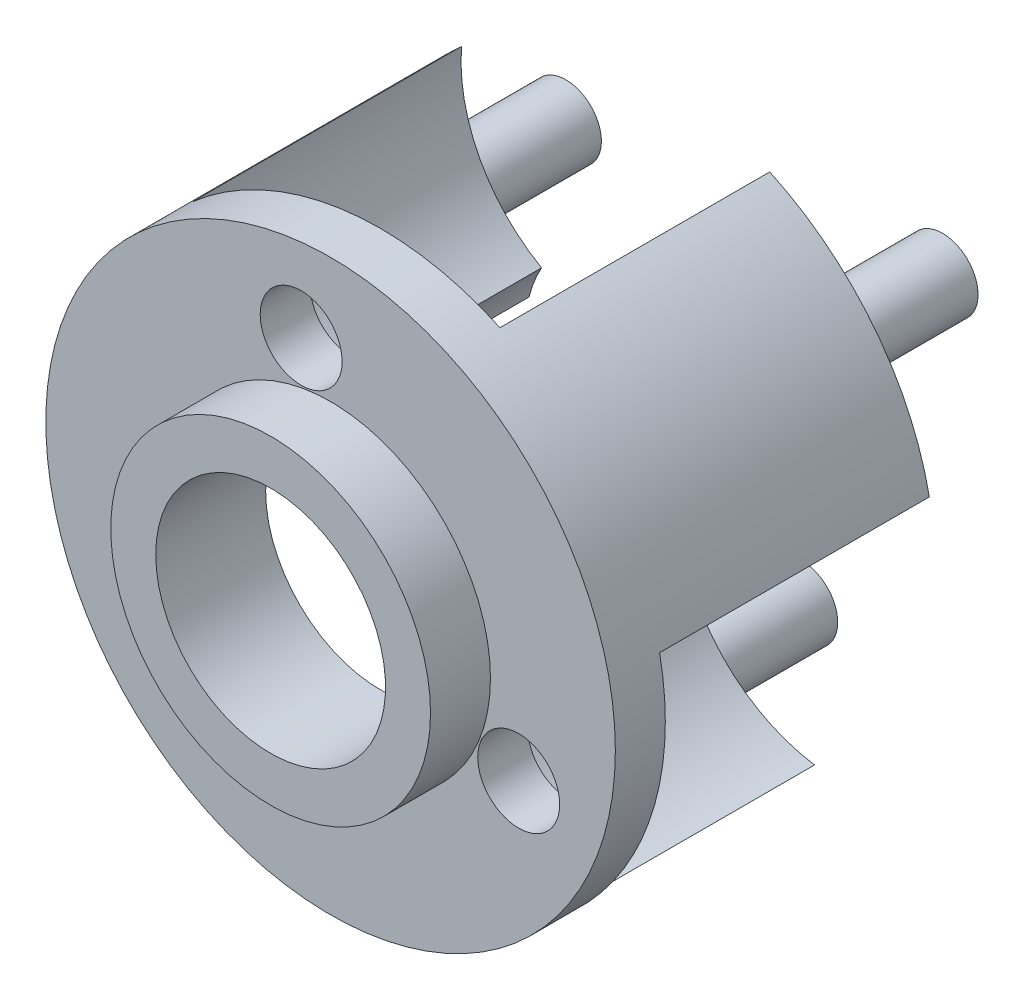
ISO-10303-21;
HEADER;
FILE_DESCRIPTION(('STEP AP214'),'2;1');
FILE_NAME('part.step','',(''),(''),'','','');
FILE_SCHEMA(('AUTOMOTIVE_DESIGN { 1 0 10303 214 1 1 1 1 }'));
ENDSEC;
DATA;
#1=APPLICATION_CONTEXT('core data for automotive mechanical design processes');
#2=APPLICATION_PROTOCOL_DEFINITION('international standard','automotive_design',2000,#1);
#3=PRODUCT_CONTEXT('',#1,'mechanical');
#4=PRODUCT('Part','Part','',(#3));
#5=PRODUCT_RELATED_PRODUCT_CATEGORY('part','',(#4));
#6=PRODUCT_DEFINITION_FORMATION('','',#4);
#7=PRODUCT_DEFINITION_CONTEXT('part definition',#1,'design');
#8=PRODUCT_DEFINITION('design','',#6,#7);
#9=PRODUCT_DEFINITION_SHAPE('','',#8);
#10=(LENGTH_UNIT() NAMED_UNIT(*) SI_UNIT(.MILLI.,.METRE.));
#11=(NAMED_UNIT(*) PLANE_ANGLE_UNIT() SI_UNIT($,.RADIAN.));
#12=(NAMED_UNIT(*) SI_UNIT($,.STERADIAN.) SOLID_ANGLE_UNIT());
#13=UNCERTAINTY_MEASURE_WITH_UNIT(LENGTH_MEASURE(1.E-05),#10,'distance_accuracy_value','');
#14=(GEOMETRIC_REPRESENTATION_CONTEXT(3) GLOBAL_UNCERTAINTY_ASSIGNED_CONTEXT((#13)) GLOBAL_UNIT_ASSIGNED_CONTEXT((#10,
#11,#12)) REPRESENTATION_CONTEXT('',''));
#15=CARTESIAN_POINT('',(0.,0.,0.));
#16=DIRECTION('',(0.,0.,1.));
#17=DIRECTION('',(1.,0.,0.));
#18=AXIS2_PLACEMENT_3D('',#15,#16,#17);
#19=CARTESIAN_POINT('',(0.,0.,6.85));
#20=DIRECTION('',(0.,0.,1.));
#21=DIRECTION('',(1.,0.,0.));
#22=AXIS2_PLACEMENT_3D('',#19,#20,#21);
#23=PLANE('',#22);
#24=CARTESIAN_POINT('',(-1.587669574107,-1.256952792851,6.85));
#25=DIRECTION('',(0.,0.,1.));
#26=DIRECTION('',(1.,0.,0.));
#27=AXIS2_PLACEMENT_3D('',#24,#25,#26);
#28=CIRCLE('',#27,0.409999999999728);
#29=CARTESIAN_POINT('',(-1.17766957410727,-1.256952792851,6.85));
#30=VERTEX_POINT('',#29);
#31=EDGE_CURVE('E363',#30,#30,#28,.T.);
#32=ORIENTED_EDGE('',*,*,#31,.F.);
#33=EDGE_LOOP('',(#32));
#34=FACE_BOUND('',#33,.T.);
#35=CARTESIAN_POINT('',(-0.294718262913,2.003438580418,6.85));
#36=DIRECTION('',(0.,0.,1.));
#37=DIRECTION('',(1.,0.,0.));
#38=AXIS2_PLACEMENT_3D('',#35,#36,#37);
#39=CIRCLE('',#38,0.409999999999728);
#40=CARTESIAN_POINT('',(0.115281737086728,2.003438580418,6.85));
#41=VERTEX_POINT('',#40);
#42=EDGE_CURVE('E369',#41,#41,#39,.T.);
#43=ORIENTED_EDGE('',*,*,#42,.F.);
#44=EDGE_LOOP('',(#43));
#45=FACE_BOUND('',#44,.T.);
#46=CARTESIAN_POINT('',(1.88238783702,-0.7464857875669,6.85));
#47=DIRECTION('',(0.,0.,1.));
#48=DIRECTION('',(1.,0.,0.));
#49=AXIS2_PLACEMENT_3D('',#46,#47,#48);
#50=CIRCLE('',#49,0.409999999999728);
#51=CARTESIAN_POINT('',(2.29238783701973,-0.7464857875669,6.85));
#52=VERTEX_POINT('',#51);
#53=EDGE_CURVE('E375',#52,#52,#50,.T.);
#54=ORIENTED_EDGE('',*,*,#53,.F.);
#55=EDGE_LOOP('',(#54));
#56=FACE_BOUND('',#55,.T.);
#57=CARTESIAN_POINT('',(0.,0.,6.85));
#58=DIRECTION('',(0.,0.,1.));
#59=DIRECTION('',(1.,0.,0.));
#60=AXIS2_PLACEMENT_3D('',#57,#58,#59);
#61=CIRCLE('',#60,2.84999999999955);
#62=CARTESIAN_POINT('',(2.84999999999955,0.,6.85));
#63=VERTEX_POINT('',#62);
#64=EDGE_CURVE('E201',#63,#63,#61,.T.);
#65=ORIENTED_EDGE('',*,*,#64,.T.);
#66=EDGE_LOOP('',(#65));
#67=FACE_BOUND('',#66,.T.);
#68=CARTESIAN_POINT('',(0.,0.,6.85));
#69=DIRECTION('',(0.,0.,1.));
#70=DIRECTION('',(1.,0.,0.));
#71=AXIS2_PLACEMENT_3D('',#68,#69,#70);
#72=CIRCLE('',#71,1.60000000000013);
#73=CARTESIAN_POINT('',(1.60000000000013,0.,6.85));
#74=VERTEX_POINT('',#73);
#75=EDGE_CURVE('E387',#74,#74,#72,.T.);
#76=ORIENTED_EDGE('',*,*,#75,.F.);
#77=EDGE_LOOP('',(#76));
#78=FACE_BOUND('',#77,.T.);
#79=ADVANCED_FACE('F34',(#34,#45,#56,#67,#78),#23,.T.);
#80=CARTESIAN_POINT('',(-0.147359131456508,1.00171929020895,6.35));
#81=DIRECTION('',(0.,0.,-1.));
#82=DIRECTION('',(-1.,0.,0.));
#83=AXIS2_PLACEMENT_3D('',#80,#81,#82);
#84=PLANE('',#83);
#85=CARTESIAN_POINT('',(0.,0.,6.35));
#86=DIRECTION('',(0.,0.,-1.));
#87=DIRECTION('',(-1.,0.,0.));
#88=AXIS2_PLACEMENT_3D('',#85,#86,#87);
#89=CIRCLE('',#88,1.14999999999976);
#90=CARTESIAN_POINT('',(-1.14999999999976,0.,6.35));
#91=VERTEX_POINT('',#90);
#92=EDGE_CURVE('E356',#91,#91,#89,.T.);
#93=ORIENTED_EDGE('',*,*,#92,.F.);
#94=EDGE_LOOP('',(#93));
#95=FACE_BOUND('',#94,.T.);
#96=CARTESIAN_POINT('',(-1.587669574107,-1.256952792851,6.35));
#97=DIRECTION('',(0.,0.,-1.));
#98=DIRECTION('',(-1.,0.,0.));
#99=AXIS2_PLACEMENT_3D('',#96,#97,#98);
#100=CIRCLE('',#99,0.409999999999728);
#101=CARTESIAN_POINT('',(-1.99766957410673,-1.256952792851,6.35));
#102=VERTEX_POINT('',#101);
#103=EDGE_CURVE('E358',#102,#102,#100,.T.);
#104=ORIENTED_EDGE('',*,*,#103,.F.);
#105=EDGE_LOOP('',(#104));
#106=FACE_BOUND('',#105,.T.);
#107=CARTESIAN_POINT('',(-0.294718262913,2.003438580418,6.35));
#108=DIRECTION('',(0.,0.,-1.));
#109=DIRECTION('',(-1.,0.,0.));
#110=AXIS2_PLACEMENT_3D('',#107,#108,#109);
#111=CIRCLE('',#110,0.409999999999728);
#112=CARTESIAN_POINT('',(-0.704718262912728,2.003438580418,6.35));
#113=VERTEX_POINT('',#112);
#114=EDGE_CURVE('E366',#113,#113,#111,.T.);
#115=ORIENTED_EDGE('',*,*,#114,.F.);
#116=EDGE_LOOP('',(#115));
#117=FACE_BOUND('',#116,.T.);
#118=CARTESIAN_POINT('',(1.88238783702,-0.7464857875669,6.35));
#119=DIRECTION('',(0.,0.,-1.));
#120=DIRECTION('',(-1.,0.,0.));
#121=AXIS2_PLACEMENT_3D('',#118,#119,#120);
#122=CIRCLE('',#121,0.409999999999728);
#123=CARTESIAN_POINT('',(1.47238783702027,-0.7464857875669,6.35));
#124=VERTEX_POINT('',#123);
#125=EDGE_CURVE('E372',#124,#124,#122,.T.);
#126=ORIENTED_EDGE('',*,*,#125,.F.);
#127=EDGE_LOOP('',(#126));
#128=FACE_BOUND('',#127,.T.);
#129=CARTESIAN_POINT('',(0.,-1.00071860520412E-13,6.35));
#130=DIRECTION('',(0.,0.,-1.));
#131=DIRECTION('',(-1.,0.,0.));
#132=AXIS2_PLACEMENT_3D('',#129,#130,#131);
#133=CIRCLE('',#132,2.84999999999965);
#134=CARTESIAN_POINT('',(2.79253473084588,0.569429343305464,6.35));
#135=VERTEX_POINT('',#134);
#136=CARTESIAN_POINT('',(1.64331321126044,-2.32852349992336,6.35));
#137=VERTEX_POINT('',#136);
#138=EDGE_CURVE('E178',#135,#137,#133,.T.);
#139=ORIENTED_EDGE('',*,*,#138,.T.);
#140=CARTESIAN_POINT('',(1.88238783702,-0.7464857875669,6.35));
#141=DIRECTION('',(0.,0.,1.));
#142=DIRECTION('',(-1.,0.,0.));
#143=AXIS2_PLACEMENT_3D('',#140,#141,#142);
#144=CIRCLE('',#143,1.59999999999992);
#145=CARTESIAN_POINT('',(0.348164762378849,-1.20053375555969,6.35));
#146=VERTEX_POINT('',#145);
#147=EDGE_CURVE('E54',#146,#137,#144,.T.);
#148=ORIENTED_EDGE('',*,*,#147,.F.);
#149=CARTESIAN_POINT('',(1.85561201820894E-13,0.,6.35));
#150=DIRECTION('',(0.,0.,1.));
#151=DIRECTION('',(-1.,0.,0.));
#152=AXIS2_PLACEMENT_3D('',#149,#150,#151);
#153=CIRCLE('',#152,1.2500000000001);
#154=CARTESIAN_POINT('',(0.0123150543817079,-1.24993933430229,6.35));
#155=VERTEX_POINT('',#154);
#156=EDGE_CURVE('E49',#155,#146,#153,.T.);
#157=ORIENTED_EDGE('',*,*,#156,.F.);
#158=CARTESIAN_POINT('',(-1.58766957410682,-1.25695279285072,6.35));
#159=DIRECTION('',(0.,0.,1.));
#160=DIRECTION('',(-1.,0.,0.));
#161=AXIS2_PLACEMENT_3D('',#158,#159,#160);
#162=CIRCLE('',#161,1.60000000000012);
#163=CARTESIAN_POINT('',(-0.90312708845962,-2.70312068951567,6.35));
#164=VERTEX_POINT('',#163);
#165=EDGE_CURVE('E243',#164,#155,#162,.T.);
#166=ORIENTED_EDGE('',*,*,#165,.F.);
#167=CARTESIAN_POINT('',(-2.8382171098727,-0.258889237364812,6.35));
#168=VERTEX_POINT('',#167);
#169=EDGE_CURVE('E181',#164,#168,#133,.T.);
#170=ORIENTED_EDGE('',*,*,#169,.T.);
#171=CARTESIAN_POINT('',(-1.587669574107,-1.256952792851,6.35));
#172=DIRECTION('',(0.,0.,1.));
#173=DIRECTION('',(-1.,0.,0.));
#174=AXIS2_PLACEMENT_3D('',#171,#172,#173);
#175=CIRCLE('',#174,1.59999999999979);
#176=CARTESIAN_POINT('',(-1.21377511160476,0.298747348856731,6.35));
#177=VERTEX_POINT('',#176);
#178=EDGE_CURVE('E145',#177,#168,#175,.T.);
#179=ORIENTED_EDGE('',*,*,#178,.F.);
#180=CARTESIAN_POINT('',(0.,0.,6.35));
#181=DIRECTION('',(0.,0.,1.));
#182=DIRECTION('',(-1.,0.,0.));
#183=AXIS2_PLACEMENT_3D('',#180,#181,#182);
#184=CIRCLE('',#183,1.25000000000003);
#185=CARTESIAN_POINT('',(-1.08863674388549,0.614304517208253,6.35));
#186=VERTEX_POINT('',#185);
#187=EDGE_CURVE('E158',#186,#177,#184,.T.);
#188=ORIENTED_EDGE('',*,*,#187,.F.);
#189=CARTESIAN_POINT('',(-0.294718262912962,2.00343858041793,6.35));
#190=DIRECTION('',(0.,0.,1.));
#191=DIRECTION('',(-1.,0.,0.));
#192=AXIS2_PLACEMENT_3D('',#189,#190,#191);
#193=CIRCLE('',#192,1.59999999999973);
#194=CARTESIAN_POINT('',(-1.88940764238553,2.13369134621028,6.35));
#195=VERTEX_POINT('',#194);
#196=EDGE_CURVE('E148',#195,#186,#193,.T.);
#197=ORIENTED_EDGE('',*,*,#196,.F.);
#198=CARTESIAN_POINT('',(1.19490389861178,2.58741273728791,6.35));
#199=VERTEX_POINT('',#198);
#200=EDGE_CURVE('E182',#195,#199,#133,.T.);
#201=ORIENTED_EDGE('',*,*,#200,.T.);
#202=CARTESIAN_POINT('',(-0.294718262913,2.003438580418,6.35));
#203=DIRECTION('',(0.,0.,-1.));
#204=DIRECTION('',(-1.,0.,0.));
#205=AXIS2_PLACEMENT_3D('',#202,#203,#204);
#206=CIRCLE('',#205,1.59999999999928);
#207=CARTESIAN_POINT('',(0.865610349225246,0.901786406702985,6.35));
#208=VERTEX_POINT('',#207);
#209=EDGE_CURVE('E180',#199,#208,#206,.T.);
#210=ORIENTED_EDGE('',*,*,#209,.T.);
#211=CARTESIAN_POINT('',(0.,-1.00071860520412E-13,6.35));
#212=DIRECTION('',(0.,0.,-1.));
#213=DIRECTION('',(-1.,0.,0.));
#214=AXIS2_PLACEMENT_3D('',#211,#212,#213);
#215=CIRCLE('',#214,1.25000000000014);
#216=CARTESIAN_POINT('',(1.07632168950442,0.635634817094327,6.35));
#217=VERTEX_POINT('',#216);
#218=EDGE_CURVE('E185',#208,#217,#215,.T.);
#219=ORIENTED_EDGE('',*,*,#218,.T.);
#220=CARTESIAN_POINT('',(1.88238783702,-0.7464857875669,6.35));
#221=DIRECTION('',(0.,0.,-1.));
#222=DIRECTION('',(-1.,0.,0.));
#223=AXIS2_PLACEMENT_3D('',#220,#221,#222);
#224=CIRCLE('',#223,1.59999999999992);
#225=EDGE_CURVE('E188',#217,#135,#224,.T.);
#226=ORIENTED_EDGE('',*,*,#225,.T.);
#227=EDGE_LOOP('',(#139,#148,#157,#166,#170,#179,#188,#197,#201,#210,#219,#226));
#228=FACE_BOUND('',#227,.T.);
#229=ADVANCED_FACE('F242',(#95,#106,#117,#128,#228),#84,.T.);
#230=CARTESIAN_POINT('',(0.,0.,3.65));
#231=DIRECTION('',(0.,0.,1.));
#232=DIRECTION('',(1.,0.,0.));
#233=AXIS2_PLACEMENT_3D('',#230,#231,#232);
#234=CYLINDRICAL_SURFACE('',#233,2.84999999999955);
#235=DIRECTION('',(0.,0.,-1.));
#236=VECTOR('',#235,1.);
#237=CARTESIAN_POINT('',(2.79253473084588,0.569429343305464,6.35));
#238=LINE('',#237,#236);
#239=CARTESIAN_POINT('',(2.79253473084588,0.569429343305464,3.65));
#240=VERTEX_POINT('',#239);
#241=EDGE_CURVE('E199',#135,#240,#238,.T.);
#242=ORIENTED_EDGE('',*,*,#241,.T.);
#243=CARTESIAN_POINT('',(0.,0.,3.65));
#244=DIRECTION('',(0.,0.,1.));
#245=DIRECTION('',(1.,0.,0.));
#246=AXIS2_PLACEMENT_3D('',#243,#244,#245);
#247=CIRCLE('',#246,2.84999999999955);
#248=CARTESIAN_POINT('',(1.19490389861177,2.58741273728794,3.65));
#249=VERTEX_POINT('',#248);
#250=EDGE_CURVE('E209',#240,#249,#247,.T.);
#251=ORIENTED_EDGE('',*,*,#250,.T.);
#252=DIRECTION('',(0.,0.,-1.));
#253=VECTOR('',#252,1.);
#254=CARTESIAN_POINT('',(1.19490389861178,2.58741273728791,6.35));
#255=LINE('',#254,#253);
#256=EDGE_CURVE('E191',#199,#249,#255,.T.);
#257=ORIENTED_EDGE('',*,*,#256,.F.);
#258=ORIENTED_EDGE('',*,*,#200,.F.);
#259=DIRECTION('',(0.,0.,1.));
#260=VECTOR('',#259,1.);
#261=CARTESIAN_POINT('',(-1.88940764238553,2.13369134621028,3.65));
#262=LINE('',#261,#260);
#263=CARTESIAN_POINT('',(-1.88940764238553,2.13369134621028,3.65));
#264=VERTEX_POINT('',#263);
#265=EDGE_CURVE('E172',#264,#195,#262,.T.);
#266=ORIENTED_EDGE('',*,*,#265,.F.);
#267=CARTESIAN_POINT('',(0.,0.,3.65));
#268=DIRECTION('',(0.,0.,-1.));
#269=DIRECTION('',(1.,0.,0.));
#270=AXIS2_PLACEMENT_3D('',#267,#268,#269);
#271=CIRCLE('',#270,2.84999999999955);
#272=CARTESIAN_POINT('',(-2.8382171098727,-0.258889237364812,3.65));
#273=VERTEX_POINT('',#272);
#274=EDGE_CURVE('E157',#273,#264,#271,.T.);
#275=ORIENTED_EDGE('',*,*,#274,.F.);
#276=DIRECTION('',(0.,0.,1.));
#277=VECTOR('',#276,1.);
#278=CARTESIAN_POINT('',(-2.8382171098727,-0.258889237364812,3.65));
#279=LINE('',#278,#277);
#280=EDGE_CURVE('E174',#273,#168,#279,.T.);
#281=ORIENTED_EDGE('',*,*,#280,.T.);
#282=ORIENTED_EDGE('',*,*,#169,.F.);
#283=DIRECTION('',(0.,0.,1.));
#284=VECTOR('',#283,1.);
#285=CARTESIAN_POINT('',(-0.90312708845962,-2.70312068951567,3.65));
#286=LINE('',#285,#284);
#287=CARTESIAN_POINT('',(-0.90312708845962,-2.70312068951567,3.65));
#288=VERTEX_POINT('',#287);
#289=EDGE_CURVE('E130',#288,#164,#286,.T.);
#290=ORIENTED_EDGE('',*,*,#289,.F.);
#291=CARTESIAN_POINT('',(1.85561201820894E-13,0.,3.65));
#292=DIRECTION('',(0.,0.,-1.));
#293=DIRECTION('',(1.,0.,0.));
#294=AXIS2_PLACEMENT_3D('',#291,#292,#293);
#295=CIRCLE('',#294,2.84999999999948);
#296=CARTESIAN_POINT('',(1.6433132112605,-2.32852349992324,3.65));
#297=VERTEX_POINT('',#296);
#298=EDGE_CURVE('E122',#297,#288,#295,.T.);
#299=ORIENTED_EDGE('',*,*,#298,.F.);
#300=DIRECTION('',(0.,0.,1.));
#301=VECTOR('',#300,1.);
#302=CARTESIAN_POINT('',(1.6433132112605,-2.32852349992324,3.65));
#303=LINE('',#302,#301);
#304=EDGE_CURVE('E128',#297,#137,#303,.T.);
#305=ORIENTED_EDGE('',*,*,#304,.T.);
#306=ORIENTED_EDGE('',*,*,#138,.F.);
#307=EDGE_LOOP('',(#242,#251,#257,#258,#266,#275,#281,#282,#290,#299,#305,#306));
#308=FACE_BOUND('',#307,.T.);
#309=ORIENTED_EDGE('',*,*,#64,.F.);
#310=EDGE_LOOP('',(#309));
#311=FACE_BOUND('',#310,.T.);
#312=ADVANCED_FACE('F36',(#308,#311),#234,.T.);
#313=CARTESIAN_POINT('',(2.84999999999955,0.,3.65));
#314=DIRECTION('',(0.,0.,-1.));
#315=DIRECTION('',(-1.,0.,0.));
#316=AXIS2_PLACEMENT_3D('',#313,#314,#315);
#317=PLANE('',#316);
#318=CARTESIAN_POINT('',(1.724875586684,1.36557834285,3.65));
#319=DIRECTION('',(0.,0.,-1.));
#320=DIRECTION('',(-1.,0.,0.));
#321=AXIS2_PLACEMENT_3D('',#318,#319,#320);
#322=CIRCLE('',#321,0.355000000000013);
#323=CARTESIAN_POINT('',(1.36987558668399,1.36557834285,3.65));
#324=VERTEX_POINT('',#323);
#325=EDGE_CURVE('E11',#324,#324,#322,.T.);
#326=ORIENTED_EDGE('',*,*,#325,.F.);
#327=EDGE_LOOP('',(#326));
#328=FACE_BOUND('',#327,.T.);
#329=CARTESIAN_POINT('',(1.88238783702,-0.7464857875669,3.65));
#330=DIRECTION('',(0.,0.,-1.));
#331=DIRECTION('',(-1.,0.,0.));
#332=AXIS2_PLACEMENT_3D('',#329,#330,#331);
#333=CIRCLE('',#332,1.59999999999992);
#334=CARTESIAN_POINT('',(1.07632168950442,0.635634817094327,3.65));
#335=VERTEX_POINT('',#334);
#336=EDGE_CURVE('E197',#335,#240,#333,.T.);
#337=ORIENTED_EDGE('',*,*,#336,.F.);
#338=CARTESIAN_POINT('',(0.,-1.00071860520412E-13,3.65));
#339=DIRECTION('',(0.,0.,-1.));
#340=DIRECTION('',(-1.,0.,0.));
#341=AXIS2_PLACEMENT_3D('',#338,#339,#340);
#342=CIRCLE('',#341,1.25000000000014);
#343=CARTESIAN_POINT('',(0.865610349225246,0.901786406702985,3.65));
#344=VERTEX_POINT('',#343);
#345=EDGE_CURVE('E194',#344,#335,#342,.T.);
#346=ORIENTED_EDGE('',*,*,#345,.F.);
#347=CARTESIAN_POINT('',(-0.294718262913,2.003438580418,3.65));
#348=DIRECTION('',(0.,0.,-1.));
#349=DIRECTION('',(-1.,0.,0.));
#350=AXIS2_PLACEMENT_3D('',#347,#348,#349);
#351=CIRCLE('',#350,1.59999999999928);
#352=EDGE_CURVE('E177',#249,#344,#351,.T.);
#353=ORIENTED_EDGE('',*,*,#352,.F.);
#354=ORIENTED_EDGE('',*,*,#250,.F.);
#355=EDGE_LOOP('',(#337,#346,#353,#354));
#356=FACE_BOUND('',#355,.T.);
#357=ADVANCED_FACE('F252',(#328,#356),#317,.T.);
#358=CARTESIAN_POINT('',(1.88238783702,-0.7464857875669,6.35));
#359=DIRECTION('',(0.,0.,-1.));
#360=DIRECTION('',(-1.,0.,0.));
#361=AXIS2_PLACEMENT_3D('',#358,#359,#360);
#362=CYLINDRICAL_SURFACE('',#361,1.59999999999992);
#363=ORIENTED_EDGE('',*,*,#336,.T.);
#364=ORIENTED_EDGE('',*,*,#241,.F.);
#365=ORIENTED_EDGE('',*,*,#225,.F.);
#366=DIRECTION('',(0.,0.,-1.));
#367=VECTOR('',#366,1.);
#368=CARTESIAN_POINT('',(1.07632168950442,0.635634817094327,6.35));
#369=LINE('',#368,#367);
#370=EDGE_CURVE('E202',#217,#335,#369,.T.);
#371=ORIENTED_EDGE('',*,*,#370,.T.);
#372=EDGE_LOOP('',(#363,#364,#365,#371));
#373=FACE_BOUND('',#372,.T.);
#374=ADVANCED_FACE('F258',(#373),#362,.F.);
#375=CARTESIAN_POINT('',(0.,-1.00071860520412E-13,6.35));
#376=DIRECTION('',(0.,0.,-1.));
#377=DIRECTION('',(-1.,0.,0.));
#378=AXIS2_PLACEMENT_3D('',#375,#376,#377);
#379=CYLINDRICAL_SURFACE('',#378,1.25000000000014);
#380=ORIENTED_EDGE('',*,*,#345,.T.);
#381=ORIENTED_EDGE('',*,*,#370,.F.);
#382=ORIENTED_EDGE('',*,*,#218,.F.);
#383=DIRECTION('',(0.,0.,-1.));
#384=VECTOR('',#383,1.);
#385=CARTESIAN_POINT('',(0.865610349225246,0.901786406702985,6.35));
#386=LINE('',#385,#384);
#387=EDGE_CURVE('E204',#208,#344,#386,.T.);
#388=ORIENTED_EDGE('',*,*,#387,.T.);
#389=EDGE_LOOP('',(#380,#381,#382,#388));
#390=FACE_BOUND('',#389,.T.);
#391=ADVANCED_FACE('F255',(#390),#379,.F.);
#392=CARTESIAN_POINT('',(-0.294718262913,2.003438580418,6.35));
#393=DIRECTION('',(0.,0.,-1.));
#394=DIRECTION('',(-1.,0.,0.));
#395=AXIS2_PLACEMENT_3D('',#392,#393,#394);
#396=CYLINDRICAL_SURFACE('',#395,1.59999999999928);
#397=ORIENTED_EDGE('',*,*,#352,.T.);
#398=ORIENTED_EDGE('',*,*,#387,.F.);
#399=ORIENTED_EDGE('',*,*,#209,.F.);
#400=ORIENTED_EDGE('',*,*,#256,.T.);
#401=EDGE_LOOP('',(#397,#398,#399,#400));
#402=FACE_BOUND('',#401,.T.);
#403=ADVANCED_FACE('F246',(#402),#396,.F.);
#404=CARTESIAN_POINT('',(-1.587669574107,-1.256952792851,3.65));
#405=DIRECTION('',(0.,0.,1.));
#406=DIRECTION('',(1.,0.,0.));
#407=AXIS2_PLACEMENT_3D('',#404,#405,#406);
#408=CYLINDRICAL_SURFACE('',#407,1.59999999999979);
#409=ORIENTED_EDGE('',*,*,#178,.T.);
#410=ORIENTED_EDGE('',*,*,#280,.F.);
#411=CARTESIAN_POINT('',(-1.587669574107,-1.256952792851,3.65));
#412=DIRECTION('',(0.,0.,1.));
#413=DIRECTION('',(-1.,0.,0.));
#414=AXIS2_PLACEMENT_3D('',#411,#412,#413);
#415=CIRCLE('',#414,1.59999999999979);
#416=CARTESIAN_POINT('',(-1.21377511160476,0.298747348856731,3.65));
#417=VERTEX_POINT('',#416);
#418=EDGE_CURVE('E154',#417,#273,#415,.T.);
#419=ORIENTED_EDGE('',*,*,#418,.F.);
#420=DIRECTION('',(0.,0.,1.));
#421=VECTOR('',#420,1.);
#422=CARTESIAN_POINT('',(-1.21377511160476,0.298747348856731,3.65));
#423=LINE('',#422,#421);
#424=EDGE_CURVE('E163',#417,#177,#423,.T.);
#425=ORIENTED_EDGE('',*,*,#424,.T.);
#426=EDGE_LOOP('',(#409,#410,#419,#425));
#427=FACE_BOUND('',#426,.T.);
#428=ADVANCED_FACE('F231',(#427),#408,.F.);
#429=CARTESIAN_POINT('',(-0.294718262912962,2.00343858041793,3.65));
#430=DIRECTION('',(0.,0.,1.));
#431=DIRECTION('',(1.,0.,0.));
#432=AXIS2_PLACEMENT_3D('',#429,#430,#431);
#433=CYLINDRICAL_SURFACE('',#432,1.59999999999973);
#434=ORIENTED_EDGE('',*,*,#196,.T.);
#435=DIRECTION('',(0.,0.,1.));
#436=VECTOR('',#435,1.);
#437=CARTESIAN_POINT('',(-1.08863674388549,0.614304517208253,3.65));
#438=LINE('',#437,#436);
#439=CARTESIAN_POINT('',(-1.08863674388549,0.614304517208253,3.65));
#440=VERTEX_POINT('',#439);
#441=EDGE_CURVE('E170',#440,#186,#438,.T.);
#442=ORIENTED_EDGE('',*,*,#441,.F.);
#443=CARTESIAN_POINT('',(-0.294718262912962,2.00343858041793,3.65));
#444=DIRECTION('',(0.,0.,1.));
#445=DIRECTION('',(-1.,0.,0.));
#446=AXIS2_PLACEMENT_3D('',#443,#444,#445);
#447=CIRCLE('',#446,1.59999999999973);
#448=EDGE_CURVE('E160',#264,#440,#447,.T.);
#449=ORIENTED_EDGE('',*,*,#448,.F.);
#450=ORIENTED_EDGE('',*,*,#265,.T.);
#451=EDGE_LOOP('',(#434,#442,#449,#450));
#452=FACE_BOUND('',#451,.T.);
#453=ADVANCED_FACE('F239',(#452),#433,.F.);
#454=CARTESIAN_POINT('',(0.,0.,3.65));
#455=DIRECTION('',(0.,0.,1.));
#456=DIRECTION('',(1.,0.,0.));
#457=AXIS2_PLACEMENT_3D('',#454,#455,#456);
#458=CYLINDRICAL_SURFACE('',#457,1.25000000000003);
#459=ORIENTED_EDGE('',*,*,#187,.T.);
#460=ORIENTED_EDGE('',*,*,#424,.F.);
#461=CARTESIAN_POINT('',(0.,0.,3.65));
#462=DIRECTION('',(0.,0.,1.));
#463=DIRECTION('',(-1.,0.,0.));
#464=AXIS2_PLACEMENT_3D('',#461,#462,#463);
#465=CIRCLE('',#464,1.25000000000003);
#466=EDGE_CURVE('E162',#440,#417,#465,.T.);
#467=ORIENTED_EDGE('',*,*,#466,.F.);
#468=ORIENTED_EDGE('',*,*,#441,.T.);
#469=EDGE_LOOP('',(#459,#460,#467,#468));
#470=FACE_BOUND('',#469,.T.);
#471=ADVANCED_FACE('F223',(#470),#458,.F.);
#472=CARTESIAN_POINT('',(-0.7938347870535,-0.6284763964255,3.65));
#473=DIRECTION('',(0.,0.,-1.));
#474=DIRECTION('',(-1.,0.,0.));
#475=AXIS2_PLACEMENT_3D('',#472,#473,#474);
#476=PLANE('',#475);
#477=CARTESIAN_POINT('',(-2.045063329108,0.810996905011,3.65));
#478=DIRECTION('',(0.,0.,-1.));
#479=DIRECTION('',(-1.,0.,0.));
#480=AXIS2_PLACEMENT_3D('',#477,#478,#479);
#481=CIRCLE('',#480,0.355000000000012);
#482=CARTESIAN_POINT('',(-2.40006332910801,0.810996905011,3.65));
#483=VERTEX_POINT('',#482);
#484=EDGE_CURVE('E42',#483,#483,#481,.T.);
#485=ORIENTED_EDGE('',*,*,#484,.F.);
#486=EDGE_LOOP('',(#485));
#487=FACE_BOUND('',#486,.T.);
#488=ORIENTED_EDGE('',*,*,#418,.T.);
#489=ORIENTED_EDGE('',*,*,#274,.T.);
#490=ORIENTED_EDGE('',*,*,#448,.T.);
#491=ORIENTED_EDGE('',*,*,#466,.T.);
#492=EDGE_LOOP('',(#488,#489,#490,#491));
#493=FACE_BOUND('',#492,.T.);
#494=ADVANCED_FACE('F220',(#487,#493),#476,.T.);
#495=CARTESIAN_POINT('',(1.88238783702,-0.7464857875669,3.65));
#496=DIRECTION('',(0.,0.,1.));
#497=DIRECTION('',(1.,0.,0.));
#498=AXIS2_PLACEMENT_3D('',#495,#496,#497);
#499=CYLINDRICAL_SURFACE('',#498,1.59999999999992);
#500=ORIENTED_EDGE('',*,*,#147,.T.);
#501=ORIENTED_EDGE('',*,*,#304,.F.);
#502=CARTESIAN_POINT('',(1.88238783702,-0.7464857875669,3.65));
#503=DIRECTION('',(0.,0.,1.));
#504=DIRECTION('',(-1.,0.,0.));
#505=AXIS2_PLACEMENT_3D('',#502,#503,#504);
#506=CIRCLE('',#505,1.59999999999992);
#507=CARTESIAN_POINT('',(0.348164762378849,-1.20053375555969,3.65));
#508=VERTEX_POINT('',#507);
#509=EDGE_CURVE('E134',#508,#297,#506,.T.);
#510=ORIENTED_EDGE('',*,*,#509,.F.);
#511=DIRECTION('',(0.,0.,1.));
#512=VECTOR('',#511,1.);
#513=CARTESIAN_POINT('',(0.348164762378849,-1.20053375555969,3.65));
#514=LINE('',#513,#512);
#515=EDGE_CURVE('E395',#508,#146,#514,.T.);
#516=ORIENTED_EDGE('',*,*,#515,.T.);
#517=EDGE_LOOP('',(#500,#501,#510,#516));
#518=FACE_BOUND('',#517,.T.);
#519=ADVANCED_FACE('F144',(#518),#499,.F.);
#520=CARTESIAN_POINT('',(-1.58766957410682,-1.25695279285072,3.65));
#521=DIRECTION('',(0.,0.,1.));
#522=DIRECTION('',(1.,0.,0.));
#523=AXIS2_PLACEMENT_3D('',#520,#521,#522);
#524=CYLINDRICAL_SURFACE('',#523,1.60000000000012);
#525=ORIENTED_EDGE('',*,*,#165,.T.);
#526=DIRECTION('',(0.,0.,1.));
#527=VECTOR('',#526,1.);
#528=CARTESIAN_POINT('',(0.0123150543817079,-1.24993933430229,3.65));
#529=LINE('',#528,#527);
#530=CARTESIAN_POINT('',(0.0123150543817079,-1.24993933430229,3.65));
#531=VERTEX_POINT('',#530);
#532=EDGE_CURVE('E150',#531,#155,#529,.T.);
#533=ORIENTED_EDGE('',*,*,#532,.F.);
#534=CARTESIAN_POINT('',(-1.58766957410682,-1.25695279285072,3.65));
#535=DIRECTION('',(0.,0.,1.));
#536=DIRECTION('',(-1.,0.,0.));
#537=AXIS2_PLACEMENT_3D('',#534,#535,#536);
#538=CIRCLE('',#537,1.60000000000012);
#539=EDGE_CURVE('E133',#288,#531,#538,.T.);
#540=ORIENTED_EDGE('',*,*,#539,.F.);
#541=ORIENTED_EDGE('',*,*,#289,.T.);
#542=EDGE_LOOP('',(#525,#533,#540,#541));
#543=FACE_BOUND('',#542,.T.);
#544=ADVANCED_FACE('F292',(#543),#524,.F.);
#545=CARTESIAN_POINT('',(1.85561201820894E-13,0.,3.65));
#546=DIRECTION('',(0.,0.,1.));
#547=DIRECTION('',(1.,0.,0.));
#548=AXIS2_PLACEMENT_3D('',#545,#546,#547);
#549=CYLINDRICAL_SURFACE('',#548,1.2500000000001);
#550=ORIENTED_EDGE('',*,*,#156,.T.);
#551=ORIENTED_EDGE('',*,*,#515,.F.);
#552=CARTESIAN_POINT('',(1.85561201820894E-13,0.,3.65));
#553=DIRECTION('',(0.,0.,1.));
#554=DIRECTION('',(-1.,0.,0.));
#555=AXIS2_PLACEMENT_3D('',#552,#553,#554);
#556=CIRCLE('',#555,1.2500000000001);
#557=EDGE_CURVE('E139',#531,#508,#556,.T.);
#558=ORIENTED_EDGE('',*,*,#557,.F.);
#559=ORIENTED_EDGE('',*,*,#532,.T.);
#560=EDGE_LOOP('',(#550,#551,#558,#559));
#561=FACE_BOUND('',#560,.T.);
#562=ADVANCED_FACE('F295',(#561),#549,.F.);
#563=CARTESIAN_POINT('',(0.941193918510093,-0.373242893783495,3.65));
#564=DIRECTION('',(0.,0.,-1.));
#565=DIRECTION('',(-1.,0.,0.));
#566=AXIS2_PLACEMENT_3D('',#563,#564,#565);
#567=PLANE('',#566);
#568=CARTESIAN_POINT('',(0.320187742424,-2.176575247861,3.65));
#569=DIRECTION('',(0.,0.,-1.));
#570=DIRECTION('',(-1.,0.,0.));
#571=AXIS2_PLACEMENT_3D('',#568,#569,#570);
#572=CIRCLE('',#571,0.35500000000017);
#573=CARTESIAN_POINT('',(-0.0348122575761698,-2.176575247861,3.65));
#574=VERTEX_POINT('',#573);
#575=EDGE_CURVE('E212',#574,#574,#572,.T.);
#576=ORIENTED_EDGE('',*,*,#575,.F.);
#577=EDGE_LOOP('',(#576));
#578=FACE_BOUND('',#577,.T.);
#579=ORIENTED_EDGE('',*,*,#509,.T.);
#580=ORIENTED_EDGE('',*,*,#298,.T.);
#581=ORIENTED_EDGE('',*,*,#539,.T.);
#582=ORIENTED_EDGE('',*,*,#557,.T.);
#583=EDGE_LOOP('',(#579,#580,#581,#582));
#584=FACE_BOUND('',#583,.T.);
#585=ADVANCED_FACE('F137',(#578,#584),#567,.T.);
#586=CARTESIAN_POINT('',(0.,0.,7.45));
#587=DIRECTION('',(0.,0.,-1.));
#588=DIRECTION('',(-1.,0.,0.));
#589=AXIS2_PLACEMENT_3D('',#586,#587,#588);
#590=CYLINDRICAL_SURFACE('',#589,1.60000000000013);
#591=CARTESIAN_POINT('',(0.,0.,7.45));
#592=DIRECTION('',(0.,0.,1.));
#593=DIRECTION('',(1.,0.,0.));
#594=AXIS2_PLACEMENT_3D('',#591,#592,#593);
#595=CIRCLE('',#594,1.60000000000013);
#596=CARTESIAN_POINT('',(1.60000000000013,0.,7.45));
#597=VERTEX_POINT('',#596);
#598=EDGE_CURVE('E388',#597,#597,#595,.T.);
#599=ORIENTED_EDGE('',*,*,#598,.F.);
#600=EDGE_LOOP('',(#599));
#601=FACE_BOUND('',#600,.T.);
#602=ORIENTED_EDGE('',*,*,#75,.T.);
#603=EDGE_LOOP('',(#602));
#604=FACE_BOUND('',#603,.T.);
#605=ADVANCED_FACE('F302',(#601,#604),#590,.T.);
#606=CARTESIAN_POINT('',(0.,0.,7.45));
#607=DIRECTION('',(0.,0.,1.));
#608=DIRECTION('',(1.,0.,0.));
#609=AXIS2_PLACEMENT_3D('',#606,#607,#608);
#610=PLANE('',#609);
#611=CARTESIAN_POINT('',(0.,0.,7.45));
#612=DIRECTION('',(0.,0.,-1.));
#613=DIRECTION('',(-1.,0.,0.));
#614=AXIS2_PLACEMENT_3D('',#611,#612,#613);
#615=CIRCLE('',#614,1.14999999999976);
#616=CARTESIAN_POINT('',(-1.14999999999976,0.,7.45));
#617=VERTEX_POINT('',#616);
#618=EDGE_CURVE('E353',#617,#617,#615,.T.);
#619=ORIENTED_EDGE('',*,*,#618,.T.);
#620=EDGE_LOOP('',(#619));
#621=FACE_BOUND('',#620,.T.);
#622=ORIENTED_EDGE('',*,*,#598,.T.);
#623=EDGE_LOOP('',(#622));
#624=FACE_BOUND('',#623,.T.);
#625=ADVANCED_FACE('F306',(#621,#624),#610,.T.);
#626=CARTESIAN_POINT('',(0.320187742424,-2.176575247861,3.65));
#627=DIRECTION('',(0.,0.,-1.));
#628=DIRECTION('',(-1.,0.,0.));
#629=AXIS2_PLACEMENT_3D('',#626,#627,#628);
#630=CYLINDRICAL_SURFACE('',#629,0.35500000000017);
#631=ORIENTED_EDGE('',*,*,#575,.T.);
#632=EDGE_LOOP('',(#631));
#633=FACE_BOUND('',#632,.T.);
#634=CARTESIAN_POINT('',(0.320187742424,-2.176575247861,2.45));
#635=DIRECTION('',(0.,0.,-1.));
#636=DIRECTION('',(-1.,0.,0.));
#637=AXIS2_PLACEMENT_3D('',#634,#635,#636);
#638=CIRCLE('',#637,0.35500000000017);
#639=CARTESIAN_POINT('',(-0.03481225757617,-2.176575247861,2.45));
#640=VERTEX_POINT('',#639);
#641=EDGE_CURVE('E384',#640,#640,#638,.T.);
#642=ORIENTED_EDGE('',*,*,#641,.F.);
#643=EDGE_LOOP('',(#642));
#644=FACE_BOUND('',#643,.T.);
#645=ADVANCED_FACE('F310',(#633,#644),#630,.T.);
#646=CARTESIAN_POINT('',(0.320187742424,-2.176575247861,2.45));
#647=DIRECTION('',(0.,0.,-1.));
#648=DIRECTION('',(-1.,0.,0.));
#649=AXIS2_PLACEMENT_3D('',#646,#647,#648);
#650=PLANE('',#649);
#651=ORIENTED_EDGE('',*,*,#641,.T.);
#652=EDGE_LOOP('',(#651));
#653=FACE_BOUND('',#652,.T.);
#654=ADVANCED_FACE('F314',(#653),#650,.T.);
#655=CARTESIAN_POINT('',(-2.045063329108,0.810996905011,3.65));
#656=DIRECTION('',(0.,0.,-1.));
#657=DIRECTION('',(-1.,0.,0.));
#658=AXIS2_PLACEMENT_3D('',#655,#656,#657);
#659=CYLINDRICAL_SURFACE('',#658,0.355000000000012);
#660=ORIENTED_EDGE('',*,*,#484,.T.);
#661=EDGE_LOOP('',(#660));
#662=FACE_BOUND('',#661,.T.);
#663=CARTESIAN_POINT('',(-2.045063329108,0.810996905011,2.45));
#664=DIRECTION('',(0.,0.,-1.));
#665=DIRECTION('',(-1.,0.,0.));
#666=AXIS2_PLACEMENT_3D('',#663,#664,#665);
#667=CIRCLE('',#666,0.355000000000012);
#668=CARTESIAN_POINT('',(-2.40006332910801,0.810996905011,2.45));
#669=VERTEX_POINT('',#668);
#670=EDGE_CURVE('E381',#669,#669,#667,.T.);
#671=ORIENTED_EDGE('',*,*,#670,.F.);
#672=EDGE_LOOP('',(#671));
#673=FACE_BOUND('',#672,.T.);
#674=ADVANCED_FACE('F217',(#662,#673),#659,.T.);
#675=CARTESIAN_POINT('',(-2.045063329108,0.810996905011,2.45));
#676=DIRECTION('',(0.,0.,-1.));
#677=DIRECTION('',(-1.,0.,0.));
#678=AXIS2_PLACEMENT_3D('',#675,#676,#677);
#679=PLANE('',#678);
#680=ORIENTED_EDGE('',*,*,#670,.T.);
#681=EDGE_LOOP('',(#680));
#682=FACE_BOUND('',#681,.T.);
#683=ADVANCED_FACE('F321',(#682),#679,.T.);
#684=CARTESIAN_POINT('',(1.724875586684,1.36557834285,3.65));
#685=DIRECTION('',(0.,0.,-1.));
#686=DIRECTION('',(-1.,0.,0.));
#687=AXIS2_PLACEMENT_3D('',#684,#685,#686);
#688=CYLINDRICAL_SURFACE('',#687,0.355000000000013);
#689=ORIENTED_EDGE('',*,*,#325,.T.);
#690=EDGE_LOOP('',(#689));
#691=FACE_BOUND('',#690,.T.);
#692=CARTESIAN_POINT('',(1.724875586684,1.36557834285,2.45));
#693=DIRECTION('',(0.,0.,-1.));
#694=DIRECTION('',(-1.,0.,0.));
#695=AXIS2_PLACEMENT_3D('',#692,#693,#694);
#696=CIRCLE('',#695,0.355000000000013);
#697=CARTESIAN_POINT('',(1.36987558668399,1.36557834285,2.45));
#698=VERTEX_POINT('',#697);
#699=EDGE_CURVE('E378',#698,#698,#696,.T.);
#700=ORIENTED_EDGE('',*,*,#699,.F.);
#701=EDGE_LOOP('',(#700));
#702=FACE_BOUND('',#701,.T.);
#703=ADVANCED_FACE('F324',(#691,#702),#688,.T.);
#704=CARTESIAN_POINT('',(1.724875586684,1.36557834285,2.45));
#705=DIRECTION('',(0.,0.,-1.));
#706=DIRECTION('',(-1.,0.,0.));
#707=AXIS2_PLACEMENT_3D('',#704,#705,#706);
#708=PLANE('',#707);
#709=ORIENTED_EDGE('',*,*,#699,.T.);
#710=EDGE_LOOP('',(#709));
#711=FACE_BOUND('',#710,.T.);
#712=ADVANCED_FACE('F328',(#711),#708,.T.);
#713=CARTESIAN_POINT('',(1.88238783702,-0.7464857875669,6.35));
#714=DIRECTION('',(0.,0.,-1.));
#715=DIRECTION('',(-1.,0.,0.));
#716=AXIS2_PLACEMENT_3D('',#713,#714,#715);
#717=CYLINDRICAL_SURFACE('',#716,0.409999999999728);
#718=ORIENTED_EDGE('',*,*,#53,.T.);
#719=EDGE_LOOP('',(#718));
#720=FACE_BOUND('',#719,.T.);
#721=ORIENTED_EDGE('',*,*,#125,.T.);
#722=EDGE_LOOP('',(#721));
#723=FACE_BOUND('',#722,.T.);
#724=ADVANCED_FACE('F332',(#720,#723),#717,.F.);
#725=CARTESIAN_POINT('',(-0.294718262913,2.003438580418,6.35));
#726=DIRECTION('',(0.,0.,-1.));
#727=DIRECTION('',(-1.,0.,0.));
#728=AXIS2_PLACEMENT_3D('',#725,#726,#727);
#729=CYLINDRICAL_SURFACE('',#728,0.409999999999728);
#730=ORIENTED_EDGE('',*,*,#42,.T.);
#731=EDGE_LOOP('',(#730));
#732=FACE_BOUND('',#731,.T.);
#733=ORIENTED_EDGE('',*,*,#114,.T.);
#734=EDGE_LOOP('',(#733));
#735=FACE_BOUND('',#734,.T.);
#736=ADVANCED_FACE('F336',(#732,#735),#729,.F.);
#737=CARTESIAN_POINT('',(-1.587669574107,-1.256952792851,6.35));
#738=DIRECTION('',(0.,0.,-1.));
#739=DIRECTION('',(-1.,0.,0.));
#740=AXIS2_PLACEMENT_3D('',#737,#738,#739);
#741=CYLINDRICAL_SURFACE('',#740,0.409999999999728);
#742=ORIENTED_EDGE('',*,*,#31,.T.);
#743=EDGE_LOOP('',(#742));
#744=FACE_BOUND('',#743,.T.);
#745=ORIENTED_EDGE('',*,*,#103,.T.);
#746=EDGE_LOOP('',(#745));
#747=FACE_BOUND('',#746,.T.);
#748=ADVANCED_FACE('F340',(#744,#747),#741,.F.);
#749=CARTESIAN_POINT('',(0.,0.,6.35));
#750=DIRECTION('',(0.,0.,-1.));
#751=DIRECTION('',(-1.,0.,0.));
#752=AXIS2_PLACEMENT_3D('',#749,#750,#751);
#753=CYLINDRICAL_SURFACE('',#752,1.14999999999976);
#754=ORIENTED_EDGE('',*,*,#618,.F.);
#755=EDGE_LOOP('',(#754));
#756=FACE_BOUND('',#755,.T.);
#757=ORIENTED_EDGE('',*,*,#92,.T.);
#758=EDGE_LOOP('',(#757));
#759=FACE_BOUND('',#758,.T.);
#760=ADVANCED_FACE('F344',(#756,#759),#753,.F.);
#761=CLOSED_SHELL('',(#79,#229,#312,#357,#374,#391,#403,#428,#453,#471,#494,#519,#544,#562,#585,
#605,#625,#645,#654,#674,#683,#703,#712,#724,#736,#748,#760));
#762=MANIFOLD_SOLID_BREP('B2',#761);
#763=ADVANCED_BREP_SHAPE_REPRESENTATION('',(#18,#762),#14);
#764=SHAPE_DEFINITION_REPRESENTATION(#9,#763);
ENDSEC;
END-ISO-10303-21;
